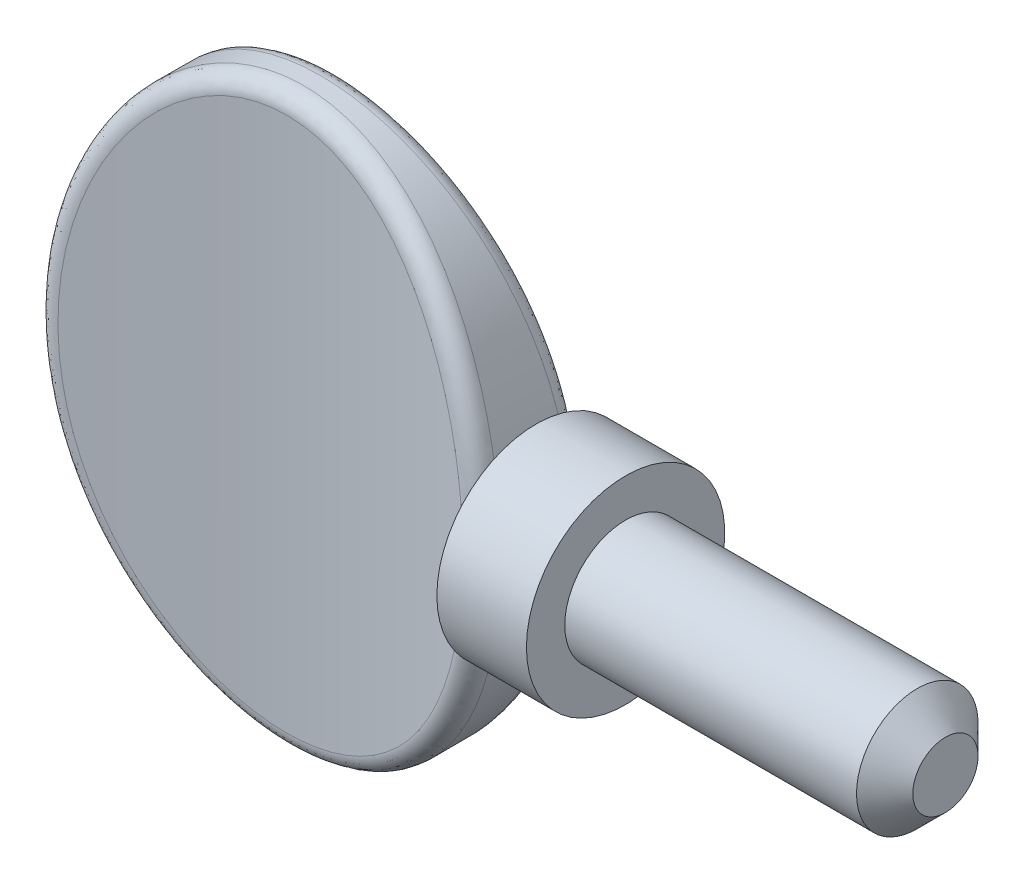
from build123d import *

# Parameters (mm, degrees)
SKETCH1_RX              = 11.303
SKETCH1_RY              = 8.889999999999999
EXTRUDE1_DEPTH          = 2.286
CUT_EXTRUDE1_DEPTH      = 15.560759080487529
CUT_EXTRUDE1_DEPTH_BACK = 15.560759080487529
SKETCH2_OUTSIDE_W       = 25.603999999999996
SKETCH2_OUTSIDE_H       = 12.396
FILLET3_R               = 0.6773333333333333


with BuildPart() as part:
    # Sketch1 → Extrude1 (new, symmetric)
    with BuildSketch(Plane.XY):
        with Locations(Location((0, 0), (0, 0, 90))):
            Ellipse(SKETCH1_RX, SKETCH1_RY)
    extrude(amount=EXTRUDE1_DEPTH, both=True)

    # Sketch2 outside → Cut-Extrude1 (cut, two sides: drawn at the far end of the back side and taken through both)
    with BuildSketch(Plane(origin=(0, 0, 0), x_dir=(1, 0, 0), z_dir=(0, 1, 0)).offset(-CUT_EXTRUDE1_DEPTH_BACK)):
        Rectangle(SKETCH2_OUTSIDE_W, SKETCH2_OUTSIDE_H)
        with BuildLine():
            Line((-8.889999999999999, 2.286), (-8.889999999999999, -2.286))
            ThreePointArc((-8.889999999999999, -2.286), (1.94e-15, -1.0159999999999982), (8.889999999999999, -2.286))
            Line((8.889999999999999, -2.286), (8.889999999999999, 2.286))
            ThreePointArc((8.889999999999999, 2.286), (1.94e-15, 1.0159999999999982), (-8.889999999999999, 2.286))
        make_face(mode=Mode.SUBTRACT)
    extrude(amount=CUT_EXTRUDE1_DEPTH + CUT_EXTRUDE1_DEPTH_BACK, mode=Mode.SUBTRACT)

    # Fillet3
    fillet3_edges = [part.edges().sort_by_distance(p)[0] for p in [
        (-6.499256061e-08, -11.302999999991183, 1.0159999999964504),
        (8.835220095e-08, -11.302999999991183, -1.0159999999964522),
    ]]
    fillet(fillet3_edges, radius=FILLET3_R)

    # Sketch3 → Revolve1 (revolve)
    with BuildSketch(Plane(origin=(0, 0, 0), x_dir=(1, 0, 0), z_dir=(0, 1, 0)), mode=Mode.PRIVATE) as revolve1_sk:
        with BuildLine():
            Line((12.445999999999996, 3.9369999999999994), (12.445999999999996, 2.413))
            Line((12.445999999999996, 2.413), (24.028399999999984, 2.413))
            Line((24.028399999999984, 2.413), (25.145999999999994, 1.2953999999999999))
            Line((25.145999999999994, 1.2953999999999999), (25.145999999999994, 0))
            Line((25.145999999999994, 0), (7.236423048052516, 0))
            Line((7.236423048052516, 0), (7.236423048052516, 1.8516557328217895))
            ThreePointArc((7.236423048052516, 1.8516557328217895), (8.426438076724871, 2.6063068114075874), (8.889999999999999, 3.9370000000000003))
            Line((8.889999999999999, 3.9370000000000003), (12.445999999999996, 3.9369999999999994))
        make_face()
    revolve(revolve1_sk.sketch.rotate(Axis((0, 0, 0), (1, 0, 0)), 180), axis=Axis((0, 0, 0), (1, 0, 0)))


solid = part.part
